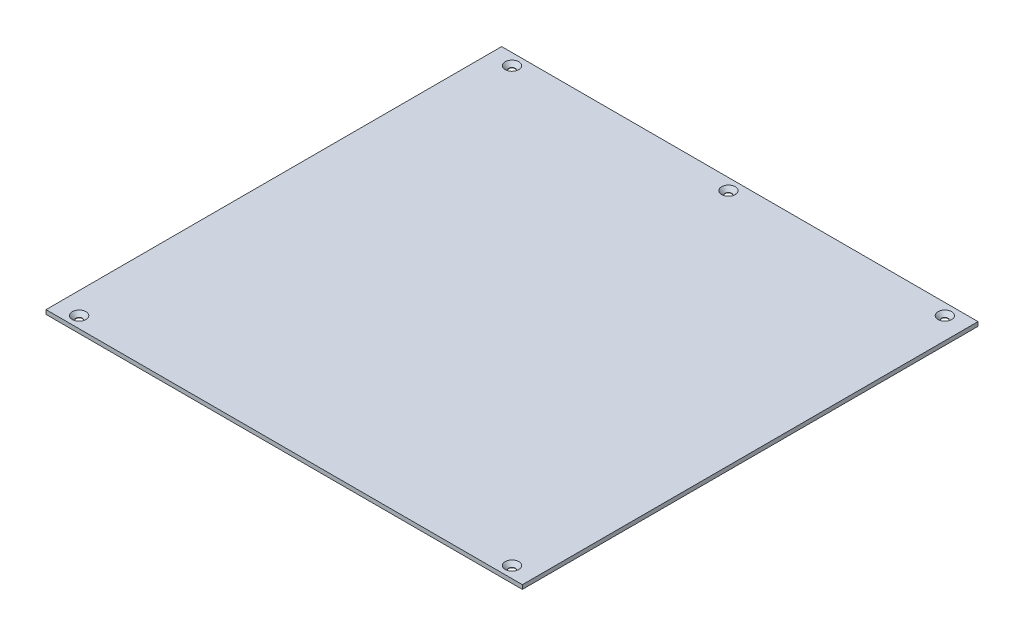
ISO-10303-21;
HEADER;
FILE_DESCRIPTION(('STEP AP214'),'2;1');
FILE_NAME('part.step','',(''),(''),'','','');
FILE_SCHEMA(('AUTOMOTIVE_DESIGN { 1 0 10303 214 1 1 1 1 }'));
ENDSEC;
DATA;
#1=APPLICATION_CONTEXT('core data for automotive mechanical design processes');
#2=APPLICATION_PROTOCOL_DEFINITION('international standard','automotive_design',2000,#1);
#3=PRODUCT_CONTEXT('',#1,'mechanical');
#4=PRODUCT('Part','Part','',(#3));
#5=PRODUCT_RELATED_PRODUCT_CATEGORY('part','',(#4));
#6=PRODUCT_DEFINITION_FORMATION('','',#4);
#7=PRODUCT_DEFINITION_CONTEXT('part definition',#1,'design');
#8=PRODUCT_DEFINITION('design','',#6,#7);
#9=PRODUCT_DEFINITION_SHAPE('','',#8);
#10=(LENGTH_UNIT() NAMED_UNIT(*) SI_UNIT(.MILLI.,.METRE.));
#11=(NAMED_UNIT(*) PLANE_ANGLE_UNIT() SI_UNIT($,.RADIAN.));
#12=(NAMED_UNIT(*) SI_UNIT($,.STERADIAN.) SOLID_ANGLE_UNIT());
#13=UNCERTAINTY_MEASURE_WITH_UNIT(LENGTH_MEASURE(1.E-05),#10,'distance_accuracy_value','');
#14=(GEOMETRIC_REPRESENTATION_CONTEXT(3) GLOBAL_UNCERTAINTY_ASSIGNED_CONTEXT((#13)) GLOBAL_UNIT_ASSIGNED_CONTEXT((#10,
#11,#12)) REPRESENTATION_CONTEXT('',''));
#15=CARTESIAN_POINT('',(0.,0.,0.));
#16=DIRECTION('',(0.,0.,1.));
#17=DIRECTION('',(1.,0.,0.));
#18=AXIS2_PLACEMENT_3D('',#15,#16,#17);
#19=CARTESIAN_POINT('',(0.,2.,0.));
#20=DIRECTION('',(0.,-1.,0.));
#21=DIRECTION('',(0.,0.,-1.));
#22=AXIS2_PLACEMENT_3D('',#19,#20,#21);
#23=PLANE('',#22);
#24=CARTESIAN_POINT('',(-104.5,2.,104.5));
#25=DIRECTION('',(0.,-1.,0.));
#26=DIRECTION('',(0.,0.,-1.));
#27=AXIS2_PLACEMENT_3D('',#24,#25,#26);
#28=CIRCLE('',#27,3.3);
#29=CARTESIAN_POINT('',(-104.5,2.,101.2));
#30=VERTEX_POINT('',#29);
#31=EDGE_CURVE('E126',#30,#30,#28,.T.);
#32=ORIENTED_EDGE('',*,*,#31,.T.);
#33=EDGE_LOOP('',(#32));
#34=FACE_BOUND('',#33,.T.);
#35=CARTESIAN_POINT('',(104.5,2.,104.5));
#36=DIRECTION('',(0.,-1.,0.));
#37=DIRECTION('',(0.,0.,-1.));
#38=AXIS2_PLACEMENT_3D('',#35,#36,#37);
#39=CIRCLE('',#38,3.3);
#40=CARTESIAN_POINT('',(104.5,2.,101.2));
#41=VERTEX_POINT('',#40);
#42=EDGE_CURVE('E123',#41,#41,#39,.T.);
#43=ORIENTED_EDGE('',*,*,#42,.T.);
#44=EDGE_LOOP('',(#43));
#45=FACE_BOUND('',#44,.T.);
#46=CARTESIAN_POINT('',(-104.5,2.,-104.5));
#47=DIRECTION('',(0.,-1.,0.));
#48=DIRECTION('',(0.,0.,-1.));
#49=AXIS2_PLACEMENT_3D('',#46,#47,#48);
#50=CIRCLE('',#49,3.3);
#51=CARTESIAN_POINT('',(-104.5,2.,-107.8));
#52=VERTEX_POINT('',#51);
#53=EDGE_CURVE('E120',#52,#52,#50,.T.);
#54=ORIENTED_EDGE('',*,*,#53,.T.);
#55=EDGE_LOOP('',(#54));
#56=FACE_BOUND('',#55,.T.);
#57=CARTESIAN_POINT('',(104.5,2.,-104.5));
#58=DIRECTION('',(0.,-1.,0.));
#59=DIRECTION('',(0.,0.,-1.));
#60=AXIS2_PLACEMENT_3D('',#57,#58,#59);
#61=CIRCLE('',#60,3.3);
#62=CARTESIAN_POINT('',(104.5,2.,-107.8));
#63=VERTEX_POINT('',#62);
#64=EDGE_CURVE('E117',#63,#63,#61,.T.);
#65=ORIENTED_EDGE('',*,*,#64,.T.);
#66=EDGE_LOOP('',(#65));
#67=FACE_BOUND('',#66,.T.);
#68=CARTESIAN_POINT('',(0.,2.,-104.5));
#69=DIRECTION('',(0.,-1.,0.));
#70=DIRECTION('',(0.,0.,-1.));
#71=AXIS2_PLACEMENT_3D('',#68,#69,#70);
#72=CIRCLE('',#71,3.3);
#73=CARTESIAN_POINT('',(0.,2.,-107.8));
#74=VERTEX_POINT('',#73);
#75=EDGE_CURVE('E114',#74,#74,#72,.T.);
#76=ORIENTED_EDGE('',*,*,#75,.T.);
#77=EDGE_LOOP('',(#76));
#78=FACE_BOUND('',#77,.T.);
#79=DIRECTION('',(0.,0.,-1.));
#80=VECTOR('',#79,1.);
#81=CARTESIAN_POINT('',(115.,2.,110.));
#82=LINE('',#81,#80);
#83=CARTESIAN_POINT('',(115.,2.,110.));
#84=VERTEX_POINT('',#83);
#85=CARTESIAN_POINT('',(115.,2.,-110.));
#86=VERTEX_POINT('',#85);
#87=EDGE_CURVE('E86',#84,#86,#82,.T.);
#88=ORIENTED_EDGE('',*,*,#87,.T.);
#89=DIRECTION('',(-1.,0.,0.));
#90=VECTOR('',#89,1.);
#91=CARTESIAN_POINT('',(-115.,2.,-110.));
#92=LINE('',#91,#90);
#93=CARTESIAN_POINT('',(-115.,2.,-110.));
#94=VERTEX_POINT('',#93);
#95=EDGE_CURVE('E82',#86,#94,#92,.T.);
#96=ORIENTED_EDGE('',*,*,#95,.T.);
#97=DIRECTION('',(0.,0.,1.));
#98=VECTOR('',#97,1.);
#99=CARTESIAN_POINT('',(-115.,2.,110.));
#100=LINE('',#99,#98);
#101=CARTESIAN_POINT('',(-115.,2.,110.));
#102=VERTEX_POINT('',#101);
#103=EDGE_CURVE('E84',#94,#102,#100,.T.);
#104=ORIENTED_EDGE('',*,*,#103,.T.);
#105=DIRECTION('',(1.,0.,0.));
#106=VECTOR('',#105,1.);
#107=CARTESIAN_POINT('',(-115.,2.,110.));
#108=LINE('',#107,#106);
#109=EDGE_CURVE('E51',#102,#84,#108,.T.);
#110=ORIENTED_EDGE('',*,*,#109,.T.);
#111=EDGE_LOOP('',(#88,#96,#104,#110));
#112=FACE_BOUND('',#111,.T.);
#113=ADVANCED_FACE('F34',(#34,#45,#56,#67,#78,#112),#23,.F.);
#114=CARTESIAN_POINT('',(0.,0.,0.));
#115=DIRECTION('',(0.,-1.,0.));
#116=DIRECTION('',(0.,0.,-1.));
#117=AXIS2_PLACEMENT_3D('',#114,#115,#116);
#118=PLANE('',#117);
#119=CARTESIAN_POINT('',(-104.5,0.,104.5));
#120=DIRECTION('',(0.,1.,0.));
#121=DIRECTION('',(0.,0.,1.));
#122=AXIS2_PLACEMENT_3D('',#119,#120,#121);
#123=CIRCLE('',#122,1.5);
#124=CARTESIAN_POINT('',(-104.5,0.,106.));
#125=VERTEX_POINT('',#124);
#126=EDGE_CURVE('E201',#125,#125,#123,.T.);
#127=ORIENTED_EDGE('',*,*,#126,.T.);
#128=EDGE_LOOP('',(#127));
#129=FACE_BOUND('',#128,.T.);
#130=CARTESIAN_POINT('',(-104.5,0.,-104.5));
#131=DIRECTION('',(0.,1.,0.));
#132=DIRECTION('',(0.,0.,-1.));
#133=AXIS2_PLACEMENT_3D('',#130,#131,#132);
#134=CIRCLE('',#133,1.5);
#135=CARTESIAN_POINT('',(-104.5,0.,-106.));
#136=VERTEX_POINT('',#135);
#137=EDGE_CURVE('E200',#136,#136,#134,.T.);
#138=ORIENTED_EDGE('',*,*,#137,.T.);
#139=EDGE_LOOP('',(#138));
#140=FACE_BOUND('',#139,.T.);
#141=DIRECTION('',(0.,0.,-1.));
#142=VECTOR('',#141,1.);
#143=CARTESIAN_POINT('',(115.,0.,110.));
#144=LINE('',#143,#142);
#145=CARTESIAN_POINT('',(115.,0.,110.));
#146=VERTEX_POINT('',#145);
#147=CARTESIAN_POINT('',(115.,0.,-110.));
#148=VERTEX_POINT('',#147);
#149=EDGE_CURVE('E101',#146,#148,#144,.T.);
#150=ORIENTED_EDGE('',*,*,#149,.F.);
#151=DIRECTION('',(1.,0.,0.));
#152=VECTOR('',#151,1.);
#153=CARTESIAN_POINT('',(-115.,0.,110.));
#154=LINE('',#153,#152);
#155=CARTESIAN_POINT('',(-115.,0.,110.));
#156=VERTEX_POINT('',#155);
#157=EDGE_CURVE('E74',#156,#146,#154,.T.);
#158=ORIENTED_EDGE('',*,*,#157,.F.);
#159=DIRECTION('',(0.,0.,1.));
#160=VECTOR('',#159,1.);
#161=CARTESIAN_POINT('',(-115.,0.,110.));
#162=LINE('',#161,#160);
#163=CARTESIAN_POINT('',(-115.,0.,-110.));
#164=VERTEX_POINT('',#163);
#165=EDGE_CURVE('E68',#164,#156,#162,.T.);
#166=ORIENTED_EDGE('',*,*,#165,.F.);
#167=DIRECTION('',(-1.,0.,0.));
#168=VECTOR('',#167,1.);
#169=CARTESIAN_POINT('',(-115.,0.,-110.));
#170=LINE('',#169,#168);
#171=EDGE_CURVE('E91',#148,#164,#170,.T.);
#172=ORIENTED_EDGE('',*,*,#171,.F.);
#173=EDGE_LOOP('',(#150,#158,#166,#172));
#174=FACE_BOUND('',#173,.T.);
#175=CARTESIAN_POINT('',(104.5,0.,-104.5));
#176=DIRECTION('',(0.,1.,0.));
#177=DIRECTION('',(0.,0.,1.));
#178=AXIS2_PLACEMENT_3D('',#175,#176,#177);
#179=CIRCLE('',#178,1.5);
#180=CARTESIAN_POINT('',(104.5,0.,-103.));
#181=VERTEX_POINT('',#180);
#182=EDGE_CURVE('E104',#181,#181,#179,.T.);
#183=ORIENTED_EDGE('',*,*,#182,.T.);
#184=EDGE_LOOP('',(#183));
#185=FACE_BOUND('',#184,.T.);
#186=CARTESIAN_POINT('',(104.5,0.,104.5));
#187=DIRECTION('',(0.,1.,0.));
#188=DIRECTION('',(0.,0.,-1.));
#189=AXIS2_PLACEMENT_3D('',#186,#187,#188);
#190=CIRCLE('',#189,1.5);
#191=CARTESIAN_POINT('',(104.5,0.,103.));
#192=VERTEX_POINT('',#191);
#193=EDGE_CURVE('E198',#192,#192,#190,.T.);
#194=ORIENTED_EDGE('',*,*,#193,.T.);
#195=EDGE_LOOP('',(#194));
#196=FACE_BOUND('',#195,.T.);
#197=CARTESIAN_POINT('',(0.,0.,-104.5));
#198=DIRECTION('',(0.,1.,0.));
#199=DIRECTION('',(0.,0.,1.));
#200=AXIS2_PLACEMENT_3D('',#197,#198,#199);
#201=CIRCLE('',#200,1.5);
#202=CARTESIAN_POINT('',(0.,0.,-103.));
#203=VERTEX_POINT('',#202);
#204=EDGE_CURVE('E206',#203,#203,#201,.T.);
#205=ORIENTED_EDGE('',*,*,#204,.T.);
#206=EDGE_LOOP('',(#205));
#207=FACE_BOUND('',#206,.T.);
#208=ADVANCED_FACE('F154',(#129,#140,#174,#185,#196,#207),#118,.T.);
#209=CARTESIAN_POINT('',(115.,2.,110.));
#210=DIRECTION('',(-1.,0.,0.));
#211=DIRECTION('',(0.,0.,1.));
#212=AXIS2_PLACEMENT_3D('',#209,#210,#211);
#213=PLANE('',#212);
#214=ORIENTED_EDGE('',*,*,#149,.T.);
#215=DIRECTION('',(0.,-1.,0.));
#216=VECTOR('',#215,1.);
#217=CARTESIAN_POINT('',(115.,2.,-110.));
#218=LINE('',#217,#216);
#219=EDGE_CURVE('E92',#86,#148,#218,.T.);
#220=ORIENTED_EDGE('',*,*,#219,.F.);
#221=ORIENTED_EDGE('',*,*,#87,.F.);
#222=DIRECTION('',(0.,-1.,0.));
#223=VECTOR('',#222,1.);
#224=CARTESIAN_POINT('',(115.,2.,110.));
#225=LINE('',#224,#223);
#226=EDGE_CURVE('E97',#84,#146,#225,.T.);
#227=ORIENTED_EDGE('',*,*,#226,.T.);
#228=EDGE_LOOP('',(#214,#220,#221,#227));
#229=FACE_BOUND('',#228,.T.);
#230=ADVANCED_FACE('F160',(#229),#213,.F.);
#231=CARTESIAN_POINT('',(-115.,2.,-110.));
#232=DIRECTION('',(0.,0.,1.));
#233=DIRECTION('',(1.,0.,0.));
#234=AXIS2_PLACEMENT_3D('',#231,#232,#233);
#235=PLANE('',#234);
#236=ORIENTED_EDGE('',*,*,#171,.T.);
#237=DIRECTION('',(0.,-1.,0.));
#238=VECTOR('',#237,1.);
#239=CARTESIAN_POINT('',(-115.,2.,-110.));
#240=LINE('',#239,#238);
#241=EDGE_CURVE('E89',#94,#164,#240,.T.);
#242=ORIENTED_EDGE('',*,*,#241,.F.);
#243=ORIENTED_EDGE('',*,*,#95,.F.);
#244=ORIENTED_EDGE('',*,*,#219,.T.);
#245=EDGE_LOOP('',(#236,#242,#243,#244));
#246=FACE_BOUND('',#245,.T.);
#247=ADVANCED_FACE('F90',(#246),#235,.F.);
#248=CARTESIAN_POINT('',(-115.,2.,110.));
#249=DIRECTION('',(1.,0.,0.));
#250=DIRECTION('',(0.,0.,-1.));
#251=AXIS2_PLACEMENT_3D('',#248,#249,#250);
#252=PLANE('',#251);
#253=ORIENTED_EDGE('',*,*,#165,.T.);
#254=DIRECTION('',(0.,-1.,0.));
#255=VECTOR('',#254,1.);
#256=CARTESIAN_POINT('',(-115.,2.,110.));
#257=LINE('',#256,#255);
#258=EDGE_CURVE('E93',#102,#156,#257,.T.);
#259=ORIENTED_EDGE('',*,*,#258,.F.);
#260=ORIENTED_EDGE('',*,*,#103,.F.);
#261=ORIENTED_EDGE('',*,*,#241,.T.);
#262=EDGE_LOOP('',(#253,#259,#260,#261));
#263=FACE_BOUND('',#262,.T.);
#264=ADVANCED_FACE('F95',(#263),#252,.F.);
#265=CARTESIAN_POINT('',(-115.,2.,110.));
#266=DIRECTION('',(0.,0.,-1.));
#267=DIRECTION('',(-1.,0.,0.));
#268=AXIS2_PLACEMENT_3D('',#265,#266,#267);
#269=PLANE('',#268);
#270=ORIENTED_EDGE('',*,*,#157,.T.);
#271=ORIENTED_EDGE('',*,*,#226,.F.);
#272=ORIENTED_EDGE('',*,*,#109,.F.);
#273=ORIENTED_EDGE('',*,*,#258,.T.);
#274=EDGE_LOOP('',(#270,#271,#272,#273));
#275=FACE_BOUND('',#274,.T.);
#276=ADVANCED_FACE('F167',(#275),#269,.F.);
#277=CARTESIAN_POINT('',(104.5,2.,-104.5));
#278=DIRECTION('',(0.,-1.,0.));
#279=DIRECTION('',(0.,0.,-1.));
#280=AXIS2_PLACEMENT_3D('',#277,#278,#279);
#281=CYLINDRICAL_SURFACE('',#280,1.5);
#282=CARTESIAN_POINT('',(104.5,0.200000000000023,-104.5));
#283=DIRECTION('',(0.,-1.,0.));
#284=DIRECTION('',(0.,0.,-1.));
#285=AXIS2_PLACEMENT_3D('',#282,#283,#284);
#286=CIRCLE('',#285,1.5);
#287=CARTESIAN_POINT('',(104.5,0.200000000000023,-106.));
#288=VERTEX_POINT('',#287);
#289=EDGE_CURVE('E43',#288,#288,#286,.F.);
#290=ORIENTED_EDGE('',*,*,#289,.T.);
#291=EDGE_LOOP('',(#290));
#292=FACE_BOUND('',#291,.T.);
#293=ORIENTED_EDGE('',*,*,#182,.F.);
#294=EDGE_LOOP('',(#293));
#295=FACE_BOUND('',#294,.T.);
#296=ADVANCED_FACE('F137',(#292,#295),#281,.F.);
#297=CARTESIAN_POINT('',(-104.5,2.,-104.5));
#298=DIRECTION('',(0.,-1.,0.));
#299=DIRECTION('',(0.,0.,-1.));
#300=AXIS2_PLACEMENT_3D('',#297,#298,#299);
#301=CYLINDRICAL_SURFACE('',#300,1.5);
#302=CARTESIAN_POINT('',(-104.5,0.200000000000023,-104.5));
#303=DIRECTION('',(0.,-1.,0.));
#304=DIRECTION('',(0.,0.,-1.));
#305=AXIS2_PLACEMENT_3D('',#302,#303,#304);
#306=CIRCLE('',#305,1.5);
#307=CARTESIAN_POINT('',(-104.5,0.200000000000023,-106.));
#308=VERTEX_POINT('',#307);
#309=EDGE_CURVE('E132',#308,#308,#306,.F.);
#310=ORIENTED_EDGE('',*,*,#309,.T.);
#311=EDGE_LOOP('',(#310));
#312=FACE_BOUND('',#311,.T.);
#313=ORIENTED_EDGE('',*,*,#137,.F.);
#314=EDGE_LOOP('',(#313));
#315=FACE_BOUND('',#314,.T.);
#316=ADVANCED_FACE('F194',(#312,#315),#301,.F.);
#317=CARTESIAN_POINT('',(104.5,2.,104.5));
#318=DIRECTION('',(0.,-1.,0.));
#319=DIRECTION('',(0.,0.,-1.));
#320=AXIS2_PLACEMENT_3D('',#317,#318,#319);
#321=CYLINDRICAL_SURFACE('',#320,1.5);
#322=CARTESIAN_POINT('',(104.5,0.200000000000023,104.5));
#323=DIRECTION('',(0.,-1.,0.));
#324=DIRECTION('',(0.,0.,-1.));
#325=AXIS2_PLACEMENT_3D('',#322,#323,#324);
#326=CIRCLE('',#325,1.5);
#327=CARTESIAN_POINT('',(104.5,0.200000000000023,103.));
#328=VERTEX_POINT('',#327);
#329=EDGE_CURVE('E129',#328,#328,#326,.F.);
#330=ORIENTED_EDGE('',*,*,#329,.T.);
#331=EDGE_LOOP('',(#330));
#332=FACE_BOUND('',#331,.T.);
#333=ORIENTED_EDGE('',*,*,#193,.F.);
#334=EDGE_LOOP('',(#333));
#335=FACE_BOUND('',#334,.T.);
#336=ADVANCED_FACE('F190',(#332,#335),#321,.F.);
#337=CARTESIAN_POINT('',(-104.5,2.,104.5));
#338=DIRECTION('',(0.,-1.,0.));
#339=DIRECTION('',(0.,0.,-1.));
#340=AXIS2_PLACEMENT_3D('',#337,#338,#339);
#341=CYLINDRICAL_SURFACE('',#340,1.5);
#342=CARTESIAN_POINT('',(-104.5,0.200000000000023,104.5));
#343=DIRECTION('',(0.,-1.,0.));
#344=DIRECTION('',(0.,0.,-1.));
#345=AXIS2_PLACEMENT_3D('',#342,#343,#344);
#346=CIRCLE('',#345,1.5);
#347=CARTESIAN_POINT('',(-104.5,0.200000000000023,103.));
#348=VERTEX_POINT('',#347);
#349=EDGE_CURVE('E111',#348,#348,#346,.F.);
#350=ORIENTED_EDGE('',*,*,#349,.T.);
#351=EDGE_LOOP('',(#350));
#352=FACE_BOUND('',#351,.T.);
#353=ORIENTED_EDGE('',*,*,#126,.F.);
#354=EDGE_LOOP('',(#353));
#355=FACE_BOUND('',#354,.T.);
#356=ADVANCED_FACE('F193',(#352,#355),#341,.F.);
#357=CARTESIAN_POINT('',(0.,2.,-104.5));
#358=DIRECTION('',(0.,-1.,0.));
#359=DIRECTION('',(0.,0.,-1.));
#360=AXIS2_PLACEMENT_3D('',#357,#358,#359);
#361=CYLINDRICAL_SURFACE('',#360,1.5);
#362=CARTESIAN_POINT('',(0.,0.199999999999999,-104.5));
#363=DIRECTION('',(0.,-1.,0.));
#364=DIRECTION('',(0.,0.,-1.));
#365=AXIS2_PLACEMENT_3D('',#362,#363,#364);
#366=CIRCLE('',#365,1.5);
#367=CARTESIAN_POINT('',(0.,0.199999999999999,-106.));
#368=VERTEX_POINT('',#367);
#369=EDGE_CURVE('E11',#368,#368,#366,.F.);
#370=ORIENTED_EDGE('',*,*,#369,.T.);
#371=EDGE_LOOP('',(#370));
#372=FACE_BOUND('',#371,.T.);
#373=ORIENTED_EDGE('',*,*,#204,.F.);
#374=EDGE_LOOP('',(#373));
#375=FACE_BOUND('',#374,.T.);
#376=ADVANCED_FACE('F180',(#372,#375),#361,.F.);
#377=CARTESIAN_POINT('',(-104.5,0.200000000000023,104.5));
#378=DIRECTION('',(0.,1.,0.));
#379=DIRECTION('',(0.,0.,1.));
#380=AXIS2_PLACEMENT_3D('',#377,#378,#379);
#381=CONICAL_SURFACE('',#380,1.5,0.785398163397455);
#382=ORIENTED_EDGE('',*,*,#31,.F.);
#383=EDGE_LOOP('',(#382));
#384=FACE_BOUND('',#383,.T.);
#385=ORIENTED_EDGE('',*,*,#349,.F.);
#386=EDGE_LOOP('',(#385));
#387=FACE_BOUND('',#386,.T.);
#388=ADVANCED_FACE('F177',(#384,#387),#381,.F.);
#389=CARTESIAN_POINT('',(104.5,0.200000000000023,104.5));
#390=DIRECTION('',(0.,1.,0.));
#391=DIRECTION('',(0.,0.,1.));
#392=AXIS2_PLACEMENT_3D('',#389,#390,#391);
#393=CONICAL_SURFACE('',#392,1.5,0.785398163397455);
#394=ORIENTED_EDGE('',*,*,#42,.F.);
#395=EDGE_LOOP('',(#394));
#396=FACE_BOUND('',#395,.T.);
#397=ORIENTED_EDGE('',*,*,#329,.F.);
#398=EDGE_LOOP('',(#397));
#399=FACE_BOUND('',#398,.T.);
#400=ADVANCED_FACE('F149',(#396,#399),#393,.F.);
#401=CARTESIAN_POINT('',(-104.5,0.200000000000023,-104.5));
#402=DIRECTION('',(0.,1.,0.));
#403=DIRECTION('',(0.,0.,1.));
#404=AXIS2_PLACEMENT_3D('',#401,#402,#403);
#405=CONICAL_SURFACE('',#404,1.5,0.785398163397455);
#406=ORIENTED_EDGE('',*,*,#53,.F.);
#407=EDGE_LOOP('',(#406));
#408=FACE_BOUND('',#407,.T.);
#409=ORIENTED_EDGE('',*,*,#309,.F.);
#410=EDGE_LOOP('',(#409));
#411=FACE_BOUND('',#410,.T.);
#412=ADVANCED_FACE('F142',(#408,#411),#405,.F.);
#413=CARTESIAN_POINT('',(104.5,0.200000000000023,-104.5));
#414=DIRECTION('',(0.,1.,0.));
#415=DIRECTION('',(0.,0.,1.));
#416=AXIS2_PLACEMENT_3D('',#413,#414,#415);
#417=CONICAL_SURFACE('',#416,1.5,0.785398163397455);
#418=ORIENTED_EDGE('',*,*,#64,.F.);
#419=EDGE_LOOP('',(#418));
#420=FACE_BOUND('',#419,.T.);
#421=ORIENTED_EDGE('',*,*,#289,.F.);
#422=EDGE_LOOP('',(#421));
#423=FACE_BOUND('',#422,.T.);
#424=ADVANCED_FACE('F140',(#420,#423),#417,.F.);
#425=CARTESIAN_POINT('',(0.,0.199999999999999,-104.5));
#426=DIRECTION('',(0.,1.,0.));
#427=DIRECTION('',(0.,0.,1.));
#428=AXIS2_PLACEMENT_3D('',#425,#426,#427);
#429=CONICAL_SURFACE('',#428,1.5,0.785398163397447);
#430=ORIENTED_EDGE('',*,*,#75,.F.);
#431=EDGE_LOOP('',(#430));
#432=FACE_BOUND('',#431,.T.);
#433=ORIENTED_EDGE('',*,*,#369,.F.);
#434=EDGE_LOOP('',(#433));
#435=FACE_BOUND('',#434,.T.);
#436=ADVANCED_FACE('F36',(#432,#435),#429,.F.);
#437=CLOSED_SHELL('',(#113,#208,#230,#247,#264,#276,#296,#316,#336,#356,#376,#388,#400,#412,
#424,#436));
#438=MANIFOLD_SOLID_BREP('B2',#437);
#439=ADVANCED_BREP_SHAPE_REPRESENTATION('',(#18,#438),#14);
#440=SHAPE_DEFINITION_REPRESENTATION(#9,#439);
ENDSEC;
END-ISO-10303-21;
